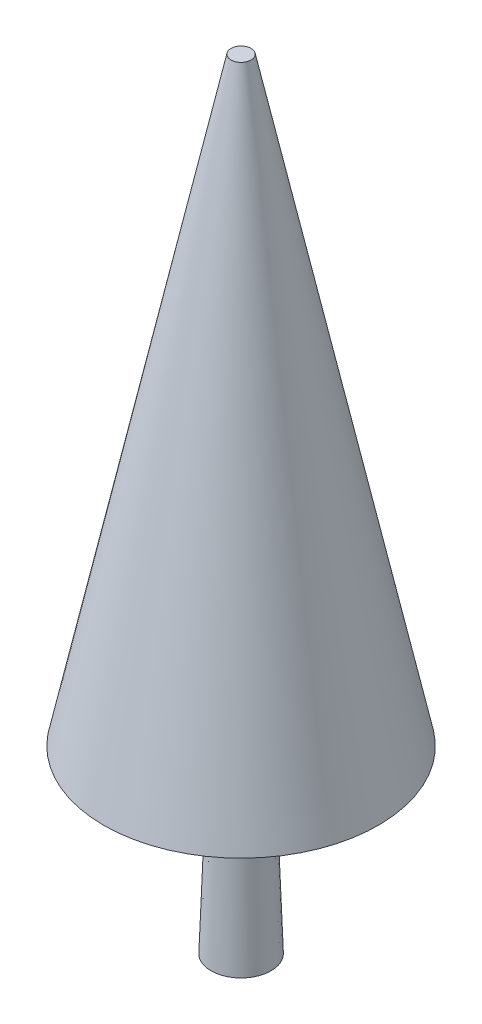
ISO-10303-21;
HEADER;
FILE_DESCRIPTION(('STEP AP214'),'2;1');
FILE_NAME('part.step','',(''),(''),'','','');
FILE_SCHEMA(('AUTOMOTIVE_DESIGN { 1 0 10303 214 1 1 1 1 }'));
ENDSEC;
DATA;
#1=APPLICATION_CONTEXT('core data for automotive mechanical design processes');
#2=APPLICATION_PROTOCOL_DEFINITION('international standard','automotive_design',2000,#1);
#3=PRODUCT_CONTEXT('',#1,'mechanical');
#4=PRODUCT('Part','Part','',(#3));
#5=PRODUCT_RELATED_PRODUCT_CATEGORY('part','',(#4));
#6=PRODUCT_DEFINITION_FORMATION('','',#4);
#7=PRODUCT_DEFINITION_CONTEXT('part definition',#1,'design');
#8=PRODUCT_DEFINITION('design','',#6,#7);
#9=PRODUCT_DEFINITION_SHAPE('','',#8);
#10=(LENGTH_UNIT() NAMED_UNIT(*) SI_UNIT(.MILLI.,.METRE.));
#11=(NAMED_UNIT(*) PLANE_ANGLE_UNIT() SI_UNIT($,.RADIAN.));
#12=(NAMED_UNIT(*) SI_UNIT($,.STERADIAN.) SOLID_ANGLE_UNIT());
#13=UNCERTAINTY_MEASURE_WITH_UNIT(LENGTH_MEASURE(1.E-05),#10,'distance_accuracy_value','');
#14=(GEOMETRIC_REPRESENTATION_CONTEXT(3) GLOBAL_UNCERTAINTY_ASSIGNED_CONTEXT((#13)) GLOBAL_UNIT_ASSIGNED_CONTEXT((#10,
#11,#12)) REPRESENTATION_CONTEXT('',''));
#15=CARTESIAN_POINT('',(0.,0.,0.));
#16=DIRECTION('',(0.,0.,1.));
#17=DIRECTION('',(1.,0.,0.));
#18=AXIS2_PLACEMENT_3D('',#15,#16,#17);
#19=CARTESIAN_POINT('',(0.,0.,0.));
#20=DIRECTION('',(0.,-1.,0.));
#21=DIRECTION('',(0.,0.,1.));
#22=AXIS2_PLACEMENT_3D('',#19,#20,#21);
#23=CONICAL_SURFACE('',#22,500.,0.0349065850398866);
#24=CARTESIAN_POINT('',(0.,3000.,0.));
#25=DIRECTION('',(0.,1.,0.));
#26=DIRECTION('',(0.,0.,1.));
#27=AXIS2_PLACEMENT_3D('',#24,#25,#26);
#28=CIRCLE('',#27,395.237691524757);
#29=CARTESIAN_POINT('',(0.,3000.,395.237691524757));
#30=VERTEX_POINT('',#29);
#31=EDGE_CURVE('E10',#30,#30,#28,.T.);
#32=ORIENTED_EDGE('',*,*,#31,.F.);
#33=EDGE_LOOP('',(#32));
#34=FACE_BOUND('',#33,.T.);
#35=CARTESIAN_POINT('',(0.,0.,0.));
#36=DIRECTION('',(0.,1.,0.));
#37=DIRECTION('',(0.,0.,1.));
#38=AXIS2_PLACEMENT_3D('',#35,#36,#37);
#39=CIRCLE('',#38,500.);
#40=CARTESIAN_POINT('',(0.,0.,500.));
#41=VERTEX_POINT('',#40);
#42=EDGE_CURVE('E37',#41,#41,#39,.T.);
#43=ORIENTED_EDGE('',*,*,#42,.T.);
#44=EDGE_LOOP('',(#43));
#45=FACE_BOUND('',#44,.T.);
#46=ADVANCED_FACE('F31',(#34,#45),#23,.T.);
#47=CARTESIAN_POINT('',(0.,0.,0.));
#48=DIRECTION('',(0.,1.,0.));
#49=DIRECTION('',(0.,0.,1.));
#50=AXIS2_PLACEMENT_3D('',#47,#48,#49);
#51=PLANE('',#50);
#52=ORIENTED_EDGE('',*,*,#42,.F.);
#53=EDGE_LOOP('',(#52));
#54=FACE_BOUND('',#53,.T.);
#55=ADVANCED_FACE('F55',(#54),#51,.F.);
#56=CARTESIAN_POINT('',(0.,3000.,0.));
#57=DIRECTION('',(0.,1.,0.));
#58=DIRECTION('',(0.,0.,1.));
#59=AXIS2_PLACEMENT_3D('',#56,#57,#58);
#60=PLANE('',#59);
#61=CARTESIAN_POINT('',(0.,3000.,0.));
#62=DIRECTION('',(0.,1.,0.));
#63=DIRECTION('',(0.,0.,1.));
#64=AXIS2_PLACEMENT_3D('',#61,#62,#63);
#65=CIRCLE('',#64,2293.1140296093);
#66=CARTESIAN_POINT('',(0.,3000.,2293.1140296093));
#67=VERTEX_POINT('',#66);
#68=EDGE_CURVE('E45',#67,#67,#65,.T.);
#69=ORIENTED_EDGE('',*,*,#68,.F.);
#70=EDGE_LOOP('',(#69));
#71=FACE_BOUND('',#70,.T.);
#72=ORIENTED_EDGE('',*,*,#31,.T.);
#73=EDGE_LOOP('',(#72));
#74=FACE_BOUND('',#73,.T.);
#75=ADVANCED_FACE('F53',(#71,#74),#60,.F.);
#76=CARTESIAN_POINT('',(0.,3000.,0.));
#77=DIRECTION('',(0.,-1.,0.));
#78=DIRECTION('',(0.,0.,1.));
#79=AXIS2_PLACEMENT_3D('',#76,#77,#78);
#80=CONICAL_SURFACE('',#79,2293.1140296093,0.20943951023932);
#81=CARTESIAN_POINT('',(0.,13000.,0.));
#82=DIRECTION('',(0.,1.,0.));
#83=DIRECTION('',(0.,0.,1.));
#84=AXIS2_PLACEMENT_3D('',#81,#82,#83);
#85=CIRCLE('',#84,167.548412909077);
#86=CARTESIAN_POINT('',(0.,13000.,167.548412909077));
#87=VERTEX_POINT('',#86);
#88=EDGE_CURVE('E41',#87,#87,#85,.T.);
#89=CARTESIAN_POINT('',(0.,13000.,167.548412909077));
#90=CARTESIAN_POINT('',(0.,12895.8333333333,189.689721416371));
#91=CARTESIAN_POINT('',(0.,12791.6666666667,211.831029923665));
#92=CARTESIAN_POINT('',(0.,12583.3333333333,256.113646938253));
#93=CARTESIAN_POINT('',(0.,12479.1666666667,278.254955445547));
#94=CARTESIAN_POINT('',(0.,12270.8333333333,322.537572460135));
#95=CARTESIAN_POINT('',(0.,12166.6666666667,344.678880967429));
#96=CARTESIAN_POINT('',(0.,11958.3333333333,388.961497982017));
#97=CARTESIAN_POINT('',(0.,11854.1666666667,411.102806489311));
#98=CARTESIAN_POINT('',(0.,11645.8333333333,455.385423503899));
#99=CARTESIAN_POINT('',(0.,11541.6666666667,477.526732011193));
#100=CARTESIAN_POINT('',(0.,11333.3333333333,521.809349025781));
#101=CARTESIAN_POINT('',(0.,11229.1666666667,543.950657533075));
#102=CARTESIAN_POINT('',(0.,11020.8333333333,588.233274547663));
#103=CARTESIAN_POINT('',(0.,10916.6666666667,610.374583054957));
#104=CARTESIAN_POINT('',(0.,10708.3333333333,654.657200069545));
#105=CARTESIAN_POINT('',(0.,10604.1666666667,676.798508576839));
#106=CARTESIAN_POINT('',(0.,10395.8333333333,721.081125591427));
#107=CARTESIAN_POINT('',(0.,10291.6666666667,743.222434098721));
#108=CARTESIAN_POINT('',(0.,10083.3333333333,787.505051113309));
#109=CARTESIAN_POINT('',(0.,9979.16666666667,809.646359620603));
#110=CARTESIAN_POINT('',(0.,9770.83333333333,853.928976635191));
#111=CARTESIAN_POINT('',(0.,9666.66666666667,876.070285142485));
#112=CARTESIAN_POINT('',(0.,9458.33333333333,920.352902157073));
#113=CARTESIAN_POINT('',(0.,9354.16666666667,942.494210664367));
#114=CARTESIAN_POINT('',(0.,9145.83333333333,986.776827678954));
#115=CARTESIAN_POINT('',(0.,9041.66666666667,1008.91813618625));
#116=CARTESIAN_POINT('',(0.,8833.33333333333,1053.20075320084));
#117=CARTESIAN_POINT('',(0.,8729.16666666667,1075.34206170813));
#118=CARTESIAN_POINT('',(0.,8520.83333333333,1119.62467872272));
#119=CARTESIAN_POINT('',(0.,8416.66666666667,1141.76598723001));
#120=CARTESIAN_POINT('',(0.,8208.33333333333,1186.0486042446));
#121=CARTESIAN_POINT('',(0.,8104.16666666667,1208.18991275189));
#122=CARTESIAN_POINT('',(0.,7895.83333333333,1252.47252976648));
#123=CARTESIAN_POINT('',(0.,7791.66666666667,1274.61383827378));
#124=CARTESIAN_POINT('',(0.,7583.33333333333,1318.89645528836));
#125=CARTESIAN_POINT('',(0.,7479.16666666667,1341.03776379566));
#126=CARTESIAN_POINT('',(0.,7270.83333333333,1385.32038081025));
#127=CARTESIAN_POINT('',(0.,7166.66666666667,1407.46168931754));
#128=CARTESIAN_POINT('',(0.,6958.33333333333,1451.74430633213));
#129=CARTESIAN_POINT('',(0.,6854.16666666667,1473.88561483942));
#130=CARTESIAN_POINT('',(0.,6645.83333333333,1518.16823185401));
#131=CARTESIAN_POINT('',(0.,6541.66666666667,1540.3095403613));
#132=CARTESIAN_POINT('',(0.,6333.33333333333,1584.59215737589));
#133=CARTESIAN_POINT('',(0.,6229.16666666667,1606.73346588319));
#134=CARTESIAN_POINT('',(0.,6020.83333333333,1651.01608289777));
#135=CARTESIAN_POINT('',(0.,5916.66666666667,1673.15739140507));
#136=CARTESIAN_POINT('',(0.,5708.33333333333,1717.44000841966));
#137=CARTESIAN_POINT('',(0.,5604.16666666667,1739.58131692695));
#138=CARTESIAN_POINT('',(0.,5395.83333333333,1783.86393394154));
#139=CARTESIAN_POINT('',(0.,5291.66666666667,1806.00524244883));
#140=CARTESIAN_POINT('',(0.,5083.33333333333,1850.28785946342));
#141=CARTESIAN_POINT('',(0.,4979.16666666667,1872.42916797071));
#142=CARTESIAN_POINT('',(0.,4770.83333333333,1916.7117849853));
#143=CARTESIAN_POINT('',(0.,4666.66666666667,1938.8530934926));
#144=CARTESIAN_POINT('',(0.,4458.33333333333,1983.13571050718));
#145=CARTESIAN_POINT('',(0.,4354.16666666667,2005.27701901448));
#146=CARTESIAN_POINT('',(0.,4145.83333333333,2049.55963602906));
#147=CARTESIAN_POINT('',(0.,4041.66666666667,2071.70094453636));
#148=CARTESIAN_POINT('',(0.,3833.33333333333,2115.98356155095));
#149=CARTESIAN_POINT('',(0.,3729.16666666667,2138.12487005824));
#150=CARTESIAN_POINT('',(0.,3520.83333333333,2182.40748707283));
#151=CARTESIAN_POINT('',(0.,3416.66666666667,2204.54879558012));
#152=CARTESIAN_POINT('',(0.,3208.33333333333,2248.83141259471));
#153=CARTESIAN_POINT('',(0.,3104.16666666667,2270.972721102));
#154=CARTESIAN_POINT('',(0.,3000.,2293.1140296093));
#155=B_SPLINE_CURVE_WITH_KNOTS('',3,(#89,#90,#91,#92,#93,#94,#95,#96,#97,#98,#99,#100,#101,#102,
#103,#104,#105,#106,#107,#108,#109,#110,#111,#112,#113,#114,#115,#116,#117,#118,#119,#120,#121,
#122,#123,#124,#125,#126,#127,#128,#129,#130,#131,#132,#133,#134,#135,#136,#137,#138,#139,#140,
#141,#142,#143,#144,#145,#146,#147,#148,#149,#150,#151,#152,#153,#154),.UNSPECIFIED.,.F.,.F.,(4,
2,2,2,2,2,2,2,2,2,2,2,2,2,2,2,2,2,2,2,2,2,2,2,2,2,2,2,2,2,2,2,4),(0.,319.481435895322,
638.962871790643,958.444307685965,1277.92574358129,1597.40717947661,1916.88861537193,
2236.37005126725,2555.85148716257,2875.3329230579,3194.81435895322,3514.29579484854,
3833.77723074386,4153.25866663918,4472.7401025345,4792.22153842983,5111.70297432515,
5431.18441022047,5750.66584611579,6070.14728201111,6389.62871790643,6709.11015380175,
7028.59158969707,7348.0730255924,7667.55446148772,7987.03589738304,8306.51733327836,
8625.99876917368,8945.480205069,9264.96164096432,9584.44307685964,9903.92451275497,
10223.4059486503),.UNSPECIFIED.);
#156=EDGE_CURVE('BSEAM51',#87,#67,#155,.T.);
#157=ORIENTED_EDGE('',*,*,#88,.F.);
#158=ORIENTED_EDGE('',*,*,#68,.T.);
#159=ORIENTED_EDGE('',*,*,#156,.T.);
#160=ORIENTED_EDGE('',*,*,#156,.F.);
#161=EDGE_LOOP('',(#157,#159,#158,#160));
#162=FACE_BOUND('',#161,.T.);
#163=ADVANCED_FACE('F51',(#162),#80,.T.);
#164=CARTESIAN_POINT('',(0.,13000.,0.));
#165=DIRECTION('',(0.,1.,0.));
#166=DIRECTION('',(0.,0.,1.));
#167=AXIS2_PLACEMENT_3D('',#164,#165,#166);
#168=PLANE('',#167);
#169=ORIENTED_EDGE('',*,*,#88,.T.);
#170=EDGE_LOOP('',(#169));
#171=FACE_BOUND('',#170,.T.);
#172=ADVANCED_FACE('F61',(#171),#168,.T.);
#173=CLOSED_SHELL('',(#46,#55,#75,#163,#172));
#174=MANIFOLD_SOLID_BREP('B2',#173);
#175=ADVANCED_BREP_SHAPE_REPRESENTATION('',(#18,#174),#14);
#176=SHAPE_DEFINITION_REPRESENTATION(#9,#175);
ENDSEC;
END-ISO-10303-21;
